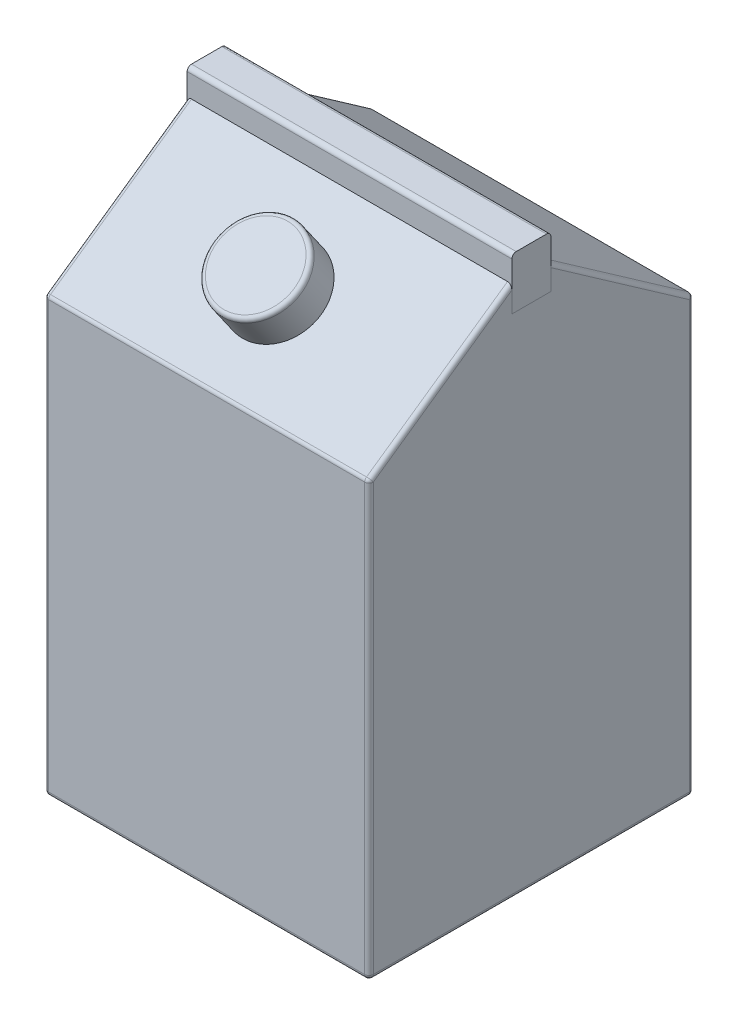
ISO-10303-21;
HEADER;
FILE_DESCRIPTION(('STEP AP214'),'2;1');
FILE_NAME('part.step','',(''),(''),'','','');
FILE_SCHEMA(('AUTOMOTIVE_DESIGN { 1 0 10303 214 1 1 1 1 }'));
ENDSEC;
DATA;
#1=APPLICATION_CONTEXT('core data for automotive mechanical design processes');
#2=APPLICATION_PROTOCOL_DEFINITION('international standard','automotive_design',2000,#1);
#3=PRODUCT_CONTEXT('',#1,'mechanical');
#4=PRODUCT('Part','Part','',(#3));
#5=PRODUCT_RELATED_PRODUCT_CATEGORY('part','',(#4));
#6=PRODUCT_DEFINITION_FORMATION('','',#4);
#7=PRODUCT_DEFINITION_CONTEXT('part definition',#1,'design');
#8=PRODUCT_DEFINITION('design','',#6,#7);
#9=PRODUCT_DEFINITION_SHAPE('','',#8);
#10=(LENGTH_UNIT() NAMED_UNIT(*) SI_UNIT(.MILLI.,.METRE.));
#11=(NAMED_UNIT(*) PLANE_ANGLE_UNIT() SI_UNIT($,.RADIAN.));
#12=(NAMED_UNIT(*) SI_UNIT($,.STERADIAN.) SOLID_ANGLE_UNIT());
#13=UNCERTAINTY_MEASURE_WITH_UNIT(LENGTH_MEASURE(1.E-05),#10,'distance_accuracy_value','');
#14=(GEOMETRIC_REPRESENTATION_CONTEXT(3) GLOBAL_UNCERTAINTY_ASSIGNED_CONTEXT((#13)) GLOBAL_UNIT_ASSIGNED_CONTEXT((#10,
#11,#12)) REPRESENTATION_CONTEXT('',''));
#15=CARTESIAN_POINT('',(0.,0.,0.));
#16=DIRECTION('',(0.,0.,1.));
#17=DIRECTION('',(1.,0.,0.));
#18=AXIS2_PLACEMENT_3D('',#15,#16,#17);
#19=CARTESIAN_POINT('',(0.,118.925792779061,26.1621879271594));
#20=DIRECTION('',(0.,-0.819152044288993,-0.573576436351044));
#21=DIRECTION('',(0.,0.573576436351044,-0.819152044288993));
#22=AXIS2_PLACEMENT_3D('',#19,#20,#21);
#23=CYLINDRICAL_SURFACE('',#22,10.);
#24=CARTESIAN_POINT('',(0.,118.106640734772,25.5886114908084));
#25=DIRECTION('',(0.,0.819152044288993,0.573576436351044));
#26=DIRECTION('',(0.,-0.573576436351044,0.819152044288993));
#27=AXIS2_PLACEMENT_3D('',#24,#25,#26);
#28=CIRCLE('',#27,10.);
#29=CARTESIAN_POINT('',(0.,112.370876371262,33.7801319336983));
#30=VERTEX_POINT('',#29);
#31=EDGE_CURVE('E11',#30,#30,#28,.F.);
#32=ORIENTED_EDGE('',*,*,#31,.T.);
#33=EDGE_LOOP('',(#32));
#34=FACE_BOUND('',#33,.T.);
#35=CARTESIAN_POINT('',(0.,111.55342438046,21.));
#36=DIRECTION('',(0.,0.819152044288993,0.573576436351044));
#37=DIRECTION('',(0.,-0.573576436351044,0.819152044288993));
#38=AXIS2_PLACEMENT_3D('',#35,#36,#37);
#39=CIRCLE('',#38,10.);
#40=CARTESIAN_POINT('',(0.,105.81766001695,29.1915204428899));
#41=VERTEX_POINT('',#40);
#42=EDGE_CURVE('E52',#41,#41,#39,.T.);
#43=ORIENTED_EDGE('',*,*,#42,.T.);
#44=EDGE_LOOP('',(#43));
#45=FACE_BOUND('',#44,.T.);
#46=ADVANCED_FACE('F41',(#34,#45),#23,.T.);
#47=CARTESIAN_POINT('',(0.,118.925792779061,26.1621879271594));
#48=DIRECTION('',(0.,0.819152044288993,0.573576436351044));
#49=DIRECTION('',(0.,-0.573576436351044,0.819152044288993));
#50=AXIS2_PLACEMENT_3D('',#47,#48,#49);
#51=PLANE('',#50);
#52=CARTESIAN_POINT('',(0.,118.925792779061,26.1621879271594));
#53=DIRECTION('',(0.,0.819152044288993,0.573576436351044));
#54=DIRECTION('',(0.,-0.573576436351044,0.819152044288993));
#55=AXIS2_PLACEMENT_3D('',#52,#53,#54);
#56=CIRCLE('',#55,9.);
#57=CARTESIAN_POINT('',(0.,113.763604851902,33.5345563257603));
#58=VERTEX_POINT('',#57);
#59=EDGE_CURVE('E48',#58,#58,#56,.T.);
#60=ORIENTED_EDGE('',*,*,#59,.T.);
#61=EDGE_LOOP('',(#60));
#62=FACE_BOUND('',#61,.T.);
#63=ADVANCED_FACE('F62',(#62),#51,.T.);
#64=CARTESIAN_POINT('',(0.,111.55342438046,21.));
#65=DIRECTION('',(0.,0.819152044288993,0.573576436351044));
#66=DIRECTION('',(0.,-0.573576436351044,0.819152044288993));
#67=AXIS2_PLACEMENT_3D('',#64,#65,#66);
#68=PLANE('',#67);
#69=ORIENTED_EDGE('',*,*,#42,.F.);
#70=EDGE_LOOP('',(#69));
#71=FACE_BOUND('',#70,.T.);
#72=ADVANCED_FACE('F60',(#71),#68,.F.);
#73=CARTESIAN_POINT('',(0.,118.106640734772,25.5886114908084));
#74=DIRECTION('',(0.,0.819152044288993,0.573576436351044));
#75=DIRECTION('',(0.,-0.573576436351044,0.819152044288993));
#76=AXIS2_PLACEMENT_3D('',#73,#74,#75);
#77=TOROIDAL_SURFACE('',#76,9.,1.);
#78=ORIENTED_EDGE('',*,*,#31,.F.);
#79=EDGE_LOOP('',(#78));
#80=FACE_BOUND('',#79,.T.);
#81=ORIENTED_EDGE('',*,*,#59,.F.);
#82=EDGE_LOOP('',(#81));
#83=FACE_BOUND('',#82,.T.);
#84=ADVANCED_FACE('F43',(#80,#83),#77,.T.);
#85=CLOSED_SHELL('',(#46,#63,#72,#84));
#86=MANIFOLD_SOLID_BREP('B2',#85);
#87=CARTESIAN_POINT('',(37.5,129.10684876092,-4.5));
#88=DIRECTION('',(0.,0.,1.));
#89=DIRECTION('',(1.,0.,0.));
#90=AXIS2_PLACEMENT_3D('',#87,#88,#89);
#91=PLANE('',#90);
#92=DIRECTION('',(0.,-1.,0.));
#93=VECTOR('',#92,1.);
#94=CARTESIAN_POINT('',(-37.5,129.10684876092,-4.5));
#95=LINE('',#94,#93);
#96=CARTESIAN_POINT('',(-37.5,128.10684876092,-4.5));
#97=VERTEX_POINT('',#96);
#98=CARTESIAN_POINT('',(-37.5,117.10684876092,-4.5));
#99=VERTEX_POINT('',#98);
#100=EDGE_CURVE('E157',#97,#99,#95,.T.);
#101=ORIENTED_EDGE('',*,*,#100,.F.);
#102=DIRECTION('',(-1.,0.,0.));
#103=VECTOR('',#102,1.);
#104=CARTESIAN_POINT('',(37.5,128.10684876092,-4.5));
#105=LINE('',#104,#103);
#106=CARTESIAN_POINT('',(37.5,128.10684876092,-4.5));
#107=VERTEX_POINT('',#106);
#108=EDGE_CURVE('E128',#97,#107,#105,.F.);
#109=ORIENTED_EDGE('',*,*,#108,.T.);
#110=DIRECTION('',(0.,-1.,0.));
#111=VECTOR('',#110,1.);
#112=CARTESIAN_POINT('',(37.5,129.10684876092,-4.5));
#113=LINE('',#112,#111);
#114=CARTESIAN_POINT('',(37.5,117.10684876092,-4.5));
#115=VERTEX_POINT('',#114);
#116=EDGE_CURVE('E177',#107,#115,#113,.T.);
#117=ORIENTED_EDGE('',*,*,#116,.T.);
#118=DIRECTION('',(-1.,0.,0.));
#119=VECTOR('',#118,1.);
#120=CARTESIAN_POINT('',(37.5,117.10684876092,-4.5));
#121=LINE('',#120,#119);
#122=EDGE_CURVE('E173',#115,#99,#121,.T.);
#123=ORIENTED_EDGE('',*,*,#122,.T.);
#124=EDGE_LOOP('',(#101,#109,#117,#123));
#125=FACE_BOUND('',#124,.T.);
#126=ADVANCED_FACE('F105',(#125),#91,.F.);
#127=CARTESIAN_POINT('',(-37.5,129.10684876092,-4.5));
#128=DIRECTION('',(1.,0.,0.));
#129=DIRECTION('',(0.,0.,-1.));
#130=AXIS2_PLACEMENT_3D('',#127,#128,#129);
#131=PLANE('',#130);
#132=DIRECTION('',(0.,0.,1.));
#133=VECTOR('',#132,1.);
#134=CARTESIAN_POINT('',(-37.5,129.10684876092,-4.5));
#135=LINE('',#134,#133);
#136=CARTESIAN_POINT('',(-37.5,129.10684876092,-3.5));
#137=VERTEX_POINT('',#136);
#138=CARTESIAN_POINT('',(-37.5,129.10684876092,3.5));
#139=VERTEX_POINT('',#138);
#140=EDGE_CURVE('E187',#137,#139,#135,.T.);
#141=ORIENTED_EDGE('',*,*,#140,.F.);
#142=CARTESIAN_POINT('',(-37.5,128.10684876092,-3.5));
#143=DIRECTION('',(1.,0.,0.));
#144=DIRECTION('',(0.,0.,-1.));
#145=AXIS2_PLACEMENT_3D('',#142,#143,#144);
#146=CIRCLE('',#145,1.);
#147=EDGE_CURVE('E164',#137,#97,#146,.F.);
#148=ORIENTED_EDGE('',*,*,#147,.T.);
#149=ORIENTED_EDGE('',*,*,#100,.T.);
#150=DIRECTION('',(0.,0.,1.));
#151=VECTOR('',#150,1.);
#152=CARTESIAN_POINT('',(-37.5,117.10684876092,-4.5));
#153=LINE('',#152,#151);
#154=CARTESIAN_POINT('',(-37.5,117.10684876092,4.5));
#155=VERTEX_POINT('',#154);
#156=EDGE_CURVE('E162',#99,#155,#153,.T.);
#157=ORIENTED_EDGE('',*,*,#156,.T.);
#158=DIRECTION('',(0.,-1.,0.));
#159=VECTOR('',#158,1.);
#160=CARTESIAN_POINT('',(-37.5,129.10684876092,4.5));
#161=LINE('',#160,#159);
#162=CARTESIAN_POINT('',(-37.5,128.10684876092,4.5));
#163=VERTEX_POINT('',#162);
#164=EDGE_CURVE('E167',#163,#155,#161,.T.);
#165=ORIENTED_EDGE('',*,*,#164,.F.);
#166=CARTESIAN_POINT('',(-37.5,128.10684876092,3.5));
#167=DIRECTION('',(1.,0.,0.));
#168=DIRECTION('',(0.,0.,-1.));
#169=AXIS2_PLACEMENT_3D('',#166,#167,#168);
#170=CIRCLE('',#169,1.);
#171=EDGE_CURVE('E197',#163,#139,#170,.F.);
#172=ORIENTED_EDGE('',*,*,#171,.T.);
#173=EDGE_LOOP('',(#141,#148,#149,#157,#165,#172));
#174=FACE_BOUND('',#173,.T.);
#175=ADVANCED_FACE('F160',(#174),#131,.F.);
#176=CARTESIAN_POINT('',(-37.5,129.10684876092,4.5));
#177=DIRECTION('',(0.,0.,-1.));
#178=DIRECTION('',(-1.,0.,0.));
#179=AXIS2_PLACEMENT_3D('',#176,#177,#178);
#180=PLANE('',#179);
#181=DIRECTION('',(0.,-1.,0.));
#182=VECTOR('',#181,1.);
#183=CARTESIAN_POINT('',(37.5,129.10684876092,4.5));
#184=LINE('',#183,#182);
#185=CARTESIAN_POINT('',(37.5,128.10684876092,4.5));
#186=VERTEX_POINT('',#185);
#187=CARTESIAN_POINT('',(37.5,117.10684876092,4.5));
#188=VERTEX_POINT('',#187);
#189=EDGE_CURVE('E189',#186,#188,#184,.T.);
#190=ORIENTED_EDGE('',*,*,#189,.F.);
#191=DIRECTION('',(1.,0.,0.));
#192=VECTOR('',#191,1.);
#193=CARTESIAN_POINT('',(-37.5,128.10684876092,4.5));
#194=LINE('',#193,#192);
#195=EDGE_CURVE('E39',#186,#163,#194,.F.);
#196=ORIENTED_EDGE('',*,*,#195,.T.);
#197=ORIENTED_EDGE('',*,*,#164,.T.);
#198=DIRECTION('',(1.,0.,0.));
#199=VECTOR('',#198,1.);
#200=CARTESIAN_POINT('',(-37.5,117.10684876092,4.5));
#201=LINE('',#200,#199);
#202=EDGE_CURVE('E175',#155,#188,#201,.T.);
#203=ORIENTED_EDGE('',*,*,#202,.T.);
#204=EDGE_LOOP('',(#190,#196,#197,#203));
#205=FACE_BOUND('',#204,.T.);
#206=ADVANCED_FACE('F223',(#205),#180,.F.);
#207=CARTESIAN_POINT('',(37.5,129.10684876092,4.5));
#208=DIRECTION('',(-1.,0.,0.));
#209=DIRECTION('',(0.,0.,1.));
#210=AXIS2_PLACEMENT_3D('',#207,#208,#209);
#211=PLANE('',#210);
#212=ORIENTED_EDGE('',*,*,#116,.F.);
#213=CARTESIAN_POINT('',(37.5,128.10684876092,-3.5));
#214=DIRECTION('',(-1.,0.,0.));
#215=DIRECTION('',(0.,0.,1.));
#216=AXIS2_PLACEMENT_3D('',#213,#214,#215);
#217=CIRCLE('',#216,1.);
#218=CARTESIAN_POINT('',(37.5,129.10684876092,-3.5));
#219=VERTEX_POINT('',#218);
#220=EDGE_CURVE('E113',#107,#219,#217,.F.);
#221=ORIENTED_EDGE('',*,*,#220,.T.);
#222=DIRECTION('',(0.,0.,-1.));
#223=VECTOR('',#222,1.);
#224=CARTESIAN_POINT('',(37.5,129.10684876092,4.5));
#225=LINE('',#224,#223);
#226=CARTESIAN_POINT('',(37.5,129.10684876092,3.5));
#227=VERTEX_POINT('',#226);
#228=EDGE_CURVE('E181',#227,#219,#225,.T.);
#229=ORIENTED_EDGE('',*,*,#228,.F.);
#230=CARTESIAN_POINT('',(37.5,128.10684876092,3.5));
#231=DIRECTION('',(-1.,0.,0.));
#232=DIRECTION('',(0.,0.,1.));
#233=AXIS2_PLACEMENT_3D('',#230,#231,#232);
#234=CIRCLE('',#233,1.);
#235=EDGE_CURVE('E120',#227,#186,#234,.F.);
#236=ORIENTED_EDGE('',*,*,#235,.T.);
#237=ORIENTED_EDGE('',*,*,#189,.T.);
#238=DIRECTION('',(0.,0.,-1.));
#239=VECTOR('',#238,1.);
#240=CARTESIAN_POINT('',(37.5,117.10684876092,4.5));
#241=LINE('',#240,#239);
#242=EDGE_CURVE('E185',#188,#115,#241,.T.);
#243=ORIENTED_EDGE('',*,*,#242,.T.);
#244=EDGE_LOOP('',(#212,#221,#229,#236,#237,#243));
#245=FACE_BOUND('',#244,.T.);
#246=ADVANCED_FACE('F203',(#245),#211,.F.);
#247=CARTESIAN_POINT('',(0.,129.10684876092,0.));
#248=DIRECTION('',(0.,1.,0.));
#249=DIRECTION('',(0.,0.,1.));
#250=AXIS2_PLACEMENT_3D('',#247,#248,#249);
#251=PLANE('',#250);
#252=ORIENTED_EDGE('',*,*,#228,.T.);
#253=DIRECTION('',(-1.,0.,0.));
#254=VECTOR('',#253,1.);
#255=CARTESIAN_POINT('',(-37.5,129.10684876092,-3.5));
#256=LINE('',#255,#254);
#257=EDGE_CURVE('E194',#219,#137,#256,.T.);
#258=ORIENTED_EDGE('',*,*,#257,.T.);
#259=ORIENTED_EDGE('',*,*,#140,.T.);
#260=DIRECTION('',(1.,0.,0.));
#261=VECTOR('',#260,1.);
#262=CARTESIAN_POINT('',(37.5,129.10684876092,3.5));
#263=LINE('',#262,#261);
#264=EDGE_CURVE('E166',#139,#227,#263,.T.);
#265=ORIENTED_EDGE('',*,*,#264,.T.);
#266=EDGE_LOOP('',(#252,#258,#259,#265));
#267=FACE_BOUND('',#266,.T.);
#268=ADVANCED_FACE('F207',(#267),#251,.T.);
#269=CARTESIAN_POINT('',(0.,117.10684876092,0.));
#270=DIRECTION('',(0.,1.,0.));
#271=DIRECTION('',(0.,0.,1.));
#272=AXIS2_PLACEMENT_3D('',#269,#270,#271);
#273=PLANE('',#272);
#274=ORIENTED_EDGE('',*,*,#122,.F.);
#275=ORIENTED_EDGE('',*,*,#242,.F.);
#276=ORIENTED_EDGE('',*,*,#202,.F.);
#277=ORIENTED_EDGE('',*,*,#156,.F.);
#278=EDGE_LOOP('',(#274,#275,#276,#277));
#279=FACE_BOUND('',#278,.T.);
#280=ADVANCED_FACE('F171',(#279),#273,.F.);
#281=CARTESIAN_POINT('',(0.,128.10684876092,-3.5));
#282=DIRECTION('',(1.,0.,0.));
#283=DIRECTION('',(0.,0.,-1.));
#284=AXIS2_PLACEMENT_3D('',#281,#282,#283);
#285=CYLINDRICAL_SURFACE('',#284,1.);
#286=ORIENTED_EDGE('',*,*,#220,.F.);
#287=ORIENTED_EDGE('',*,*,#108,.F.);
#288=ORIENTED_EDGE('',*,*,#147,.F.);
#289=ORIENTED_EDGE('',*,*,#257,.F.);
#290=EDGE_LOOP('',(#286,#287,#288,#289));
#291=FACE_BOUND('',#290,.T.);
#292=ADVANCED_FACE('F210',(#291),#285,.T.);
#293=CARTESIAN_POINT('',(0.,128.10684876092,3.5));
#294=DIRECTION('',(-1.,0.,0.));
#295=DIRECTION('',(0.,0.,1.));
#296=AXIS2_PLACEMENT_3D('',#293,#294,#295);
#297=CYLINDRICAL_SURFACE('',#296,1.);
#298=ORIENTED_EDGE('',*,*,#171,.F.);
#299=ORIENTED_EDGE('',*,*,#195,.F.);
#300=ORIENTED_EDGE('',*,*,#235,.F.);
#301=ORIENTED_EDGE('',*,*,#264,.F.);
#302=EDGE_LOOP('',(#298,#299,#300,#301));
#303=FACE_BOUND('',#302,.T.);
#304=ADVANCED_FACE('F107',(#303),#297,.T.);
#305=CLOSED_SHELL('',(#126,#175,#206,#246,#268,#280,#292,#304));
#306=MANIFOLD_SOLID_BREP('B6',#305);
#307=CARTESIAN_POINT('',(37.5,100.,37.5));
#308=DIRECTION('',(0.,0.,-1.));
#309=DIRECTION('',(0.,1.,0.));
#310=AXIS2_PLACEMENT_3D('',#307,#308,#309);
#311=PLANE('',#310);
#312=DIRECTION('',(-1.,0.,0.));
#313=VECTOR('',#312,1.);
#314=CARTESIAN_POINT('',(37.5,99.4794329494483,37.5));
#315=LINE('',#314,#313);
#316=CARTESIAN_POINT('',(36.5,99.4794329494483,37.5));
#317=VERTEX_POINT('',#316);
#318=CARTESIAN_POINT('',(-36.5,99.4794329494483,37.5));
#319=VERTEX_POINT('',#318);
#320=EDGE_CURVE('E455',#317,#319,#315,.T.);
#321=ORIENTED_EDGE('',*,*,#320,.T.);
#322=DIRECTION('',(0.,-1.,0.));
#323=VECTOR('',#322,1.);
#324=CARTESIAN_POINT('',(-36.5,100.,37.5));
#325=LINE('',#324,#323);
#326=CARTESIAN_POINT('',(-36.5,1.,37.5));
#327=VERTEX_POINT('',#326);
#328=EDGE_CURVE('E460',#319,#327,#325,.T.);
#329=ORIENTED_EDGE('',*,*,#328,.T.);
#330=DIRECTION('',(-1.,0.,0.));
#331=VECTOR('',#330,1.);
#332=CARTESIAN_POINT('',(37.5,1.,37.5));
#333=LINE('',#332,#331);
#334=CARTESIAN_POINT('',(36.5,1.,37.5));
#335=VERTEX_POINT('',#334);
#336=EDGE_CURVE('E457',#327,#335,#333,.F.);
#337=ORIENTED_EDGE('',*,*,#336,.T.);
#338=DIRECTION('',(0.,-1.,0.));
#339=VECTOR('',#338,1.);
#340=CARTESIAN_POINT('',(36.5,100.,37.5));
#341=LINE('',#340,#339);
#342=EDGE_CURVE('E453',#335,#317,#341,.F.);
#343=ORIENTED_EDGE('',*,*,#342,.T.);
#344=EDGE_LOOP('',(#321,#329,#337,#343));
#345=FACE_BOUND('',#344,.T.);
#346=ADVANCED_FACE('F280',(#345),#311,.F.);
#347=CARTESIAN_POINT('',(37.5,0.,37.5));
#348=DIRECTION('',(0.,1.,0.));
#349=DIRECTION('',(0.,0.,1.));
#350=AXIS2_PLACEMENT_3D('',#347,#348,#349);
#351=PLANE('',#350);
#352=DIRECTION('',(0.,0.,-1.));
#353=VECTOR('',#352,1.);
#354=CARTESIAN_POINT('',(36.5,0.,37.5));
#355=LINE('',#354,#353);
#356=CARTESIAN_POINT('',(36.5,0.,-36.5));
#357=VERTEX_POINT('',#356);
#358=CARTESIAN_POINT('',(36.5,0.,36.5));
#359=VERTEX_POINT('',#358);
#360=EDGE_CURVE('E448',#357,#359,#355,.F.);
#361=ORIENTED_EDGE('',*,*,#360,.T.);
#362=DIRECTION('',(-1.,0.,0.));
#363=VECTOR('',#362,1.);
#364=CARTESIAN_POINT('',(37.5,0.,36.5));
#365=LINE('',#364,#363);
#366=CARTESIAN_POINT('',(-36.5,0.,36.5));
#367=VERTEX_POINT('',#366);
#368=EDGE_CURVE('E450',#359,#367,#365,.T.);
#369=ORIENTED_EDGE('',*,*,#368,.T.);
#370=DIRECTION('',(0.,0.,-1.));
#371=VECTOR('',#370,1.);
#372=CARTESIAN_POINT('',(-36.5,0.,37.5));
#373=LINE('',#372,#371);
#374=CARTESIAN_POINT('',(-36.5,0.,-36.5));
#375=VERTEX_POINT('',#374);
#376=EDGE_CURVE('E444',#367,#375,#373,.T.);
#377=ORIENTED_EDGE('',*,*,#376,.T.);
#378=DIRECTION('',(-1.,0.,0.));
#379=VECTOR('',#378,1.);
#380=CARTESIAN_POINT('',(37.5,0.,-36.5));
#381=LINE('',#380,#379);
#382=EDGE_CURVE('E446',#375,#357,#381,.F.);
#383=ORIENTED_EDGE('',*,*,#382,.T.);
#384=EDGE_LOOP('',(#361,#369,#377,#383));
#385=FACE_BOUND('',#384,.T.);
#386=ADVANCED_FACE('F624',(#385),#351,.F.);
#387=CARTESIAN_POINT('',(37.5,100.,-37.5));
#388=DIRECTION('',(0.,0.,1.));
#389=DIRECTION('',(0.,-1.,0.));
#390=AXIS2_PLACEMENT_3D('',#387,#388,#389);
#391=PLANE('',#390);
#392=DIRECTION('',(0.,1.,0.));
#393=VECTOR('',#392,1.);
#394=CARTESIAN_POINT('',(36.5,0.,-37.5));
#395=LINE('',#394,#393);
#396=CARTESIAN_POINT('',(36.5,99.4794329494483,-37.5));
#397=VERTEX_POINT('',#396);
#398=CARTESIAN_POINT('',(36.5,1.00000000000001,-37.5));
#399=VERTEX_POINT('',#398);
#400=EDGE_CURVE('E472',#397,#399,#395,.F.);
#401=ORIENTED_EDGE('',*,*,#400,.T.);
#402=DIRECTION('',(-1.,0.,0.));
#403=VECTOR('',#402,1.);
#404=CARTESIAN_POINT('',(37.5,1.00000000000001,-37.5));
#405=LINE('',#404,#403);
#406=CARTESIAN_POINT('',(-36.5,1.00000000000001,-37.5));
#407=VERTEX_POINT('',#406);
#408=EDGE_CURVE('E478',#399,#407,#405,.T.);
#409=ORIENTED_EDGE('',*,*,#408,.T.);
#410=DIRECTION('',(0.,1.,0.));
#411=VECTOR('',#410,1.);
#412=CARTESIAN_POINT('',(-36.5,100.,-37.5));
#413=LINE('',#412,#411);
#414=CARTESIAN_POINT('',(-36.5,99.4794329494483,-37.5));
#415=VERTEX_POINT('',#414);
#416=EDGE_CURVE('E476',#407,#415,#413,.T.);
#417=ORIENTED_EDGE('',*,*,#416,.T.);
#418=DIRECTION('',(-1.,0.,0.));
#419=VECTOR('',#418,1.);
#420=CARTESIAN_POINT('',(37.5,99.4794329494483,-37.5));
#421=LINE('',#420,#419);
#422=EDGE_CURVE('E474',#415,#397,#421,.F.);
#423=ORIENTED_EDGE('',*,*,#422,.T.);
#424=EDGE_LOOP('',(#401,#409,#417,#423));
#425=FACE_BOUND('',#424,.T.);
#426=ADVANCED_FACE('F584',(#425),#391,.F.);
#427=CARTESIAN_POINT('',(37.5,123.10684876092,-4.49999999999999));
#428=DIRECTION('',(0.,-0.819152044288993,0.573576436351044));
#429=DIRECTION('',(0.,-0.573576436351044,-0.819152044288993));
#430=AXIS2_PLACEMENT_3D('',#427,#428,#429);
#431=PLANE('',#430);
#432=DIRECTION('',(-1.,0.,0.));
#433=VECTOR('',#432,1.);
#434=CARTESIAN_POINT('',(37.5,100.298584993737,-37.073576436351));
#435=LINE('',#434,#433);
#436=CARTESIAN_POINT('',(36.5,100.298584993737,-37.073576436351));
#437=VERTEX_POINT('',#436);
#438=CARTESIAN_POINT('',(-36.5,100.298584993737,-37.073576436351));
#439=VERTEX_POINT('',#438);
#440=EDGE_CURVE('E493',#437,#439,#435,.T.);
#441=ORIENTED_EDGE('',*,*,#440,.T.);
#442=DIRECTION('',(0.,0.573576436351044,0.819152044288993));
#443=VECTOR('',#442,1.);
#444=CARTESIAN_POINT('',(-36.5,123.10684876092,-4.49999999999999));
#445=LINE('',#444,#443);
#446=CARTESIAN_POINT('',(-36.5,123.10684876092,-4.49999999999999));
#447=VERTEX_POINT('',#446);
#448=EDGE_CURVE('E495',#439,#447,#445,.T.);
#449=ORIENTED_EDGE('',*,*,#448,.T.);
#450=DIRECTION('',(-1.,0.,0.));
#451=VECTOR('',#450,1.);
#452=CARTESIAN_POINT('',(37.5,123.10684876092,-4.49999999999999));
#453=LINE('',#452,#451);
#454=CARTESIAN_POINT('',(36.5,123.10684876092,-4.49999999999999));
#455=VERTEX_POINT('',#454);
#456=EDGE_CURVE('E425',#455,#447,#453,.T.);
#457=ORIENTED_EDGE('',*,*,#456,.F.);
#458=DIRECTION('',(0.,0.573576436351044,0.819152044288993));
#459=VECTOR('',#458,1.);
#460=CARTESIAN_POINT('',(36.5,100.,-37.5));
#461=LINE('',#460,#459);
#462=EDGE_CURVE('E491',#455,#437,#461,.F.);
#463=ORIENTED_EDGE('',*,*,#462,.T.);
#464=EDGE_LOOP('',(#441,#449,#457,#463));
#465=FACE_BOUND('',#464,.T.);
#466=ADVANCED_FACE('F614',(#465),#431,.F.);
#467=CARTESIAN_POINT('',(37.5,117.10684876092,-4.5));
#468=DIRECTION('',(0.,0.,-1.));
#469=DIRECTION('',(0.,1.,0.));
#470=AXIS2_PLACEMENT_3D('',#467,#468,#469);
#471=PLANE('',#470);
#472=ORIENTED_EDGE('',*,*,#456,.T.);
#473=CARTESIAN_POINT('',(-36.5,121.886074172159,-4.49999999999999));
#474=DIRECTION('',(0.,0.,-1.));
#475=DIRECTION('',(0.,1.,0.));
#476=AXIS2_PLACEMENT_3D('',#473,#474,#475);
#477=ELLIPSE('',#476,1.22077458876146,1.);
#478=CARTESIAN_POINT('',(-37.5,121.886074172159,-4.49999999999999));
#479=VERTEX_POINT('',#478);
#480=EDGE_CURVE('E499',#447,#479,#477,.F.);
#481=ORIENTED_EDGE('',*,*,#480,.T.);
#482=DIRECTION('',(0.,-1.,0.));
#483=VECTOR('',#482,1.);
#484=CARTESIAN_POINT('',(-37.5,117.10684876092,-4.5));
#485=LINE('',#484,#483);
#486=CARTESIAN_POINT('',(-37.5,117.10684876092,-4.5));
#487=VERTEX_POINT('',#486);
#488=EDGE_CURVE('E422',#479,#487,#485,.T.);
#489=ORIENTED_EDGE('',*,*,#488,.T.);
#490=DIRECTION('',(-1.,0.,0.));
#491=VECTOR('',#490,1.);
#492=CARTESIAN_POINT('',(37.5,117.10684876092,-4.5));
#493=LINE('',#492,#491);
#494=CARTESIAN_POINT('',(37.5,117.10684876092,-4.5));
#495=VERTEX_POINT('',#494);
#496=EDGE_CURVE('E418',#495,#487,#493,.T.);
#497=ORIENTED_EDGE('',*,*,#496,.F.);
#498=DIRECTION('',(0.,-1.,0.));
#499=VECTOR('',#498,1.);
#500=CARTESIAN_POINT('',(37.5,117.10684876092,-4.5));
#501=LINE('',#500,#499);
#502=CARTESIAN_POINT('',(37.5,121.886074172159,-4.49999999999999));
#503=VERTEX_POINT('',#502);
#504=EDGE_CURVE('E404',#503,#495,#501,.T.);
#505=ORIENTED_EDGE('',*,*,#504,.F.);
#506=CARTESIAN_POINT('',(36.5,121.886074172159,-4.5));
#507=DIRECTION('',(0.,0.,-1.));
#508=DIRECTION('',(0.,-1.,0.));
#509=AXIS2_PLACEMENT_3D('',#506,#507,#508);
#510=ELLIPSE('',#509,1.22077458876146,1.);
#511=EDGE_CURVE('E497',#503,#455,#510,.F.);
#512=ORIENTED_EDGE('',*,*,#511,.T.);
#513=EDGE_LOOP('',(#472,#481,#489,#497,#505,#512));
#514=FACE_BOUND('',#513,.T.);
#515=ADVANCED_FACE('F420',(#514),#471,.F.);
#516=CARTESIAN_POINT('',(37.5,117.10684876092,4.5));
#517=DIRECTION('',(0.,-1.,0.));
#518=DIRECTION('',(0.,0.,-1.));
#519=AXIS2_PLACEMENT_3D('',#516,#517,#518);
#520=PLANE('',#519);
#521=DIRECTION('',(0.,0.,1.));
#522=VECTOR('',#521,1.);
#523=CARTESIAN_POINT('',(-37.5,117.10684876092,4.5));
#524=LINE('',#523,#522);
#525=CARTESIAN_POINT('',(-37.5,117.10684876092,4.5));
#526=VERTEX_POINT('',#525);
#527=EDGE_CURVE('E437',#487,#526,#524,.T.);
#528=ORIENTED_EDGE('',*,*,#527,.T.);
#529=DIRECTION('',(-1.,0.,0.));
#530=VECTOR('',#529,1.);
#531=CARTESIAN_POINT('',(37.5,117.10684876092,4.5));
#532=LINE('',#531,#530);
#533=CARTESIAN_POINT('',(37.5,117.10684876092,4.5));
#534=VERTEX_POINT('',#533);
#535=EDGE_CURVE('E426',#534,#526,#532,.T.);
#536=ORIENTED_EDGE('',*,*,#535,.F.);
#537=DIRECTION('',(0.,0.,1.));
#538=VECTOR('',#537,1.);
#539=CARTESIAN_POINT('',(37.5,117.10684876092,4.5));
#540=LINE('',#539,#538);
#541=EDGE_CURVE('E409',#495,#534,#540,.T.);
#542=ORIENTED_EDGE('',*,*,#541,.F.);
#543=ORIENTED_EDGE('',*,*,#496,.T.);
#544=EDGE_LOOP('',(#528,#536,#542,#543));
#545=FACE_BOUND('',#544,.T.);
#546=ADVANCED_FACE('F428',(#545),#520,.F.);
#547=CARTESIAN_POINT('',(37.5,123.10684876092,4.49999999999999));
#548=DIRECTION('',(0.,0.,1.));
#549=DIRECTION('',(0.,-1.,0.));
#550=AXIS2_PLACEMENT_3D('',#547,#548,#549);
#551=PLANE('',#550);
#552=DIRECTION('',(0.,1.,0.));
#553=VECTOR('',#552,1.);
#554=CARTESIAN_POINT('',(-37.5,123.10684876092,4.49999999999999));
#555=LINE('',#554,#553);
#556=CARTESIAN_POINT('',(-37.5,121.886074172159,4.49999999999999));
#557=VERTEX_POINT('',#556);
#558=EDGE_CURVE('E415',#526,#557,#555,.T.);
#559=ORIENTED_EDGE('',*,*,#558,.T.);
#560=CARTESIAN_POINT('',(-36.5,121.886074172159,4.5));
#561=DIRECTION('',(0.,0.,1.));
#562=DIRECTION('',(0.,-1.,0.));
#563=AXIS2_PLACEMENT_3D('',#560,#561,#562);
#564=ELLIPSE('',#563,1.22077458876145,1.);
#565=CARTESIAN_POINT('',(-36.5,123.10684876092,4.49999999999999));
#566=VERTEX_POINT('',#565);
#567=EDGE_CURVE('E103',#557,#566,#564,.F.);
#568=ORIENTED_EDGE('',*,*,#567,.T.);
#569=DIRECTION('',(-1.,0.,0.));
#570=VECTOR('',#569,1.);
#571=CARTESIAN_POINT('',(37.5,123.10684876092,4.49999999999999));
#572=LINE('',#571,#570);
#573=CARTESIAN_POINT('',(36.5,123.10684876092,4.49999999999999));
#574=VERTEX_POINT('',#573);
#575=EDGE_CURVE('E433',#574,#566,#572,.T.);
#576=ORIENTED_EDGE('',*,*,#575,.F.);
#577=CARTESIAN_POINT('',(36.5,121.886074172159,4.5));
#578=DIRECTION('',(0.,0.,1.));
#579=DIRECTION('',(0.,1.,0.));
#580=AXIS2_PLACEMENT_3D('',#577,#578,#579);
#581=ELLIPSE('',#580,1.22077458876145,1.);
#582=CARTESIAN_POINT('',(37.5,121.886074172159,4.49999999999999));
#583=VERTEX_POINT('',#582);
#584=EDGE_CURVE('E289',#574,#583,#581,.F.);
#585=ORIENTED_EDGE('',*,*,#584,.T.);
#586=DIRECTION('',(0.,1.,0.));
#587=VECTOR('',#586,1.);
#588=CARTESIAN_POINT('',(37.5,123.10684876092,4.49999999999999));
#589=LINE('',#588,#587);
#590=EDGE_CURVE('E431',#534,#583,#589,.T.);
#591=ORIENTED_EDGE('',*,*,#590,.F.);
#592=ORIENTED_EDGE('',*,*,#535,.T.);
#593=EDGE_LOOP('',(#559,#568,#576,#585,#591,#592));
#594=FACE_BOUND('',#593,.T.);
#595=ADVANCED_FACE('F849',(#594),#551,.F.);
#596=CARTESIAN_POINT('',(37.5,100.,37.5));
#597=DIRECTION('',(0.,-0.819152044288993,-0.573576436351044));
#598=DIRECTION('',(0.,0.573576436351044,-0.819152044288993));
#599=AXIS2_PLACEMENT_3D('',#596,#597,#598);
#600=PLANE('',#599);
#601=ORIENTED_EDGE('',*,*,#575,.T.);
#602=DIRECTION('',(0.,-0.573576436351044,0.819152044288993));
#603=VECTOR('',#602,1.);
#604=CARTESIAN_POINT('',(-36.5,100.,37.5));
#605=LINE('',#604,#603);
#606=CARTESIAN_POINT('',(-36.5,100.298584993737,37.0735764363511));
#607=VERTEX_POINT('',#606);
#608=EDGE_CURVE('E297',#566,#607,#605,.T.);
#609=ORIENTED_EDGE('',*,*,#608,.T.);
#610=DIRECTION('',(-1.,0.,0.));
#611=VECTOR('',#610,1.);
#612=CARTESIAN_POINT('',(37.5,100.298584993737,37.0735764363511));
#613=LINE('',#612,#611);
#614=CARTESIAN_POINT('',(36.5,100.298584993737,37.0735764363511));
#615=VERTEX_POINT('',#614);
#616=EDGE_CURVE('E301',#607,#615,#613,.F.);
#617=ORIENTED_EDGE('',*,*,#616,.T.);
#618=DIRECTION('',(0.,-0.573576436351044,0.819152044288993));
#619=VECTOR('',#618,1.);
#620=CARTESIAN_POINT('',(36.5,123.10684876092,4.5));
#621=LINE('',#620,#619);
#622=EDGE_CURVE('E501',#615,#574,#621,.F.);
#623=ORIENTED_EDGE('',*,*,#622,.T.);
#624=EDGE_LOOP('',(#601,#609,#617,#623));
#625=FACE_BOUND('',#624,.T.);
#626=ADVANCED_FACE('F841',(#625),#600,.F.);
#627=CARTESIAN_POINT('',(37.5,0.,0.));
#628=DIRECTION('',(1.,0.,0.));
#629=DIRECTION('',(0.,0.,-1.));
#630=AXIS2_PLACEMENT_3D('',#627,#628,#629);
#631=PLANE('',#630);
#632=DIRECTION('',(0.,1.,0.));
#633=VECTOR('',#632,1.);
#634=CARTESIAN_POINT('',(37.5,100.,-36.5));
#635=LINE('',#634,#633);
#636=CARTESIAN_POINT('',(37.5,1.00000000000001,-36.5));
#637=VERTEX_POINT('',#636);
#638=CARTESIAN_POINT('',(37.5,99.4794329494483,-36.5));
#639=VERTEX_POINT('',#638);
#640=EDGE_CURVE('E469',#637,#639,#635,.T.);
#641=ORIENTED_EDGE('',*,*,#640,.T.);
#642=DIRECTION('',(0.,0.573576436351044,0.819152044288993));
#643=VECTOR('',#642,1.);
#644=CARTESIAN_POINT('',(37.5,122.287696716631,-3.92642356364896));
#645=LINE('',#644,#643);
#646=EDGE_CURVE('E412',#639,#503,#645,.T.);
#647=ORIENTED_EDGE('',*,*,#646,.T.);
#648=ORIENTED_EDGE('',*,*,#504,.T.);
#649=ORIENTED_EDGE('',*,*,#541,.T.);
#650=ORIENTED_EDGE('',*,*,#590,.T.);
#651=DIRECTION('',(0.,-0.573576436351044,0.819152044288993));
#652=VECTOR('',#651,1.);
#653=CARTESIAN_POINT('',(37.5,99.180847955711,36.926423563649));
#654=LINE('',#653,#652);
#655=CARTESIAN_POINT('',(37.5,99.4794329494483,36.5));
#656=VERTEX_POINT('',#655);
#657=EDGE_CURVE('E464',#583,#656,#654,.T.);
#658=ORIENTED_EDGE('',*,*,#657,.T.);
#659=DIRECTION('',(0.,-1.,0.));
#660=VECTOR('',#659,1.);
#661=CARTESIAN_POINT('',(37.5,0.,36.5));
#662=LINE('',#661,#660);
#663=CARTESIAN_POINT('',(37.5,1.,36.5));
#664=VERTEX_POINT('',#663);
#665=EDGE_CURVE('E462',#656,#664,#662,.T.);
#666=ORIENTED_EDGE('',*,*,#665,.T.);
#667=DIRECTION('',(0.,0.,-1.));
#668=VECTOR('',#667,1.);
#669=CARTESIAN_POINT('',(37.5,1.00000000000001,-37.5));
#670=LINE('',#669,#668);
#671=EDGE_CURVE('E466',#664,#637,#670,.T.);
#672=ORIENTED_EDGE('',*,*,#671,.T.);
#673=EDGE_LOOP('',(#641,#647,#648,#649,#650,#658,#666,#672));
#674=FACE_BOUND('',#673,.T.);
#675=ADVANCED_FACE('F406',(#674),#631,.T.);
#676=CARTESIAN_POINT('',(-37.5,0.,0.));
#677=DIRECTION('',(1.,0.,0.));
#678=DIRECTION('',(0.,0.,-1.));
#679=AXIS2_PLACEMENT_3D('',#676,#677,#678);
#680=PLANE('',#679);
#681=ORIENTED_EDGE('',*,*,#488,.F.);
#682=DIRECTION('',(0.,0.573576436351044,0.819152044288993));
#683=VECTOR('',#682,1.);
#684=CARTESIAN_POINT('',(-37.5,83.9010917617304,-58.7481769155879));
#685=LINE('',#684,#683);
#686=CARTESIAN_POINT('',(-37.5,99.4794329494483,-36.5));
#687=VERTEX_POINT('',#686);
#688=EDGE_CURVE('E489',#479,#687,#685,.F.);
#689=ORIENTED_EDGE('',*,*,#688,.T.);
#690=DIRECTION('',(0.,1.,0.));
#691=VECTOR('',#690,1.);
#692=CARTESIAN_POINT('',(-37.5,0.,-36.5));
#693=LINE('',#692,#691);
#694=CARTESIAN_POINT('',(-37.5,1.00000000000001,-36.5));
#695=VERTEX_POINT('',#694);
#696=EDGE_CURVE('E487',#687,#695,#693,.F.);
#697=ORIENTED_EDGE('',*,*,#696,.T.);
#698=DIRECTION('',(0.,0.,-1.));
#699=VECTOR('',#698,1.);
#700=CARTESIAN_POINT('',(-37.5,1.00000000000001,0.));
#701=LINE('',#700,#699);
#702=CARTESIAN_POINT('',(-37.5,1.,36.5));
#703=VERTEX_POINT('',#702);
#704=EDGE_CURVE('E485',#695,#703,#701,.F.);
#705=ORIENTED_EDGE('',*,*,#704,.T.);
#706=DIRECTION('',(0.,-1.,0.));
#707=VECTOR('',#706,1.);
#708=CARTESIAN_POINT('',(-37.5,0.,36.5));
#709=LINE('',#708,#707);
#710=CARTESIAN_POINT('',(-37.5,99.4794329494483,36.5));
#711=VERTEX_POINT('',#710);
#712=EDGE_CURVE('E481',#703,#711,#709,.F.);
#713=ORIENTED_EDGE('',*,*,#712,.T.);
#714=DIRECTION('',(0.,-0.573576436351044,0.819152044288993));
#715=VECTOR('',#714,1.);
#716=CARTESIAN_POINT('',(-37.5,83.9010917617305,58.7481769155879));
#717=LINE('',#716,#715);
#718=EDGE_CURVE('E483',#711,#557,#717,.F.);
#719=ORIENTED_EDGE('',*,*,#718,.T.);
#720=ORIENTED_EDGE('',*,*,#558,.F.);
#721=ORIENTED_EDGE('',*,*,#527,.F.);
#722=EDGE_LOOP('',(#681,#689,#697,#705,#713,#719,#720,#721));
#723=FACE_BOUND('',#722,.T.);
#724=ADVANCED_FACE('F616',(#723),#680,.F.);
#725=CARTESIAN_POINT('',(36.5,83.9010917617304,-58.7481769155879));
#726=DIRECTION('',(0.,-0.573576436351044,-0.819152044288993));
#727=DIRECTION('',(0.,0.819152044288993,-0.573576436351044));
#728=AXIS2_PLACEMENT_3D('',#725,#726,#727);
#729=CYLINDRICAL_SURFACE('',#728,1.);
#730=ORIENTED_EDGE('',*,*,#511,.F.);
#731=ORIENTED_EDGE('',*,*,#646,.F.);
#732=CARTESIAN_POINT('',(36.5,99.4794329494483,-36.5));
#733=DIRECTION('',(0.,-0.573576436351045,-0.819152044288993));
#734=DIRECTION('',(0.,0.819152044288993,-0.573576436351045));
#735=AXIS2_PLACEMENT_3D('',#732,#733,#734);
#736=CIRCLE('',#735,1.);
#737=EDGE_CURVE('E284',#437,#639,#736,.T.);
#738=ORIENTED_EDGE('',*,*,#737,.F.);
#739=ORIENTED_EDGE('',*,*,#462,.F.);
#740=EDGE_LOOP('',(#730,#731,#738,#739));
#741=FACE_BOUND('',#740,.T.);
#742=ADVANCED_FACE('F282',(#741),#729,.T.);
#743=CARTESIAN_POINT('',(37.5,99.4794329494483,-36.5));
#744=DIRECTION('',(-1.,0.,0.));
#745=DIRECTION('',(0.,0.,1.));
#746=AXIS2_PLACEMENT_3D('',#743,#744,#745);
#747=CYLINDRICAL_SURFACE('',#746,1.);
#748=CARTESIAN_POINT('',(-36.5,99.4794329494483,-36.5));
#749=DIRECTION('',(-1.,0.,0.));
#750=DIRECTION('',(0.,0.,1.));
#751=AXIS2_PLACEMENT_3D('',#748,#749,#750);
#752=CIRCLE('',#751,1.);
#753=EDGE_CURVE('E565',#439,#415,#752,.T.);
#754=ORIENTED_EDGE('',*,*,#753,.F.);
#755=ORIENTED_EDGE('',*,*,#440,.F.);
#756=CARTESIAN_POINT('',(36.5,99.4794329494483,-36.5));
#757=DIRECTION('',(1.,0.,0.));
#758=DIRECTION('',(0.,0.,-1.));
#759=AXIS2_PLACEMENT_3D('',#756,#757,#758);
#760=CIRCLE('',#759,1.);
#761=EDGE_CURVE('E567',#397,#437,#760,.T.);
#762=ORIENTED_EDGE('',*,*,#761,.F.);
#763=ORIENTED_EDGE('',*,*,#422,.F.);
#764=EDGE_LOOP('',(#754,#755,#762,#763));
#765=FACE_BOUND('',#764,.T.);
#766=ADVANCED_FACE('F602',(#765),#747,.T.);
#767=CARTESIAN_POINT('',(-36.5,122.287696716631,-3.92642356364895));
#768=DIRECTION('',(0.,0.573576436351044,0.819152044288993));
#769=DIRECTION('',(0.,-0.819152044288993,0.573576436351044));
#770=AXIS2_PLACEMENT_3D('',#767,#768,#769);
#771=CYLINDRICAL_SURFACE('',#770,1.);
#772=ORIENTED_EDGE('',*,*,#480,.F.);
#773=ORIENTED_EDGE('',*,*,#448,.F.);
#774=CARTESIAN_POINT('',(-36.5,99.4794329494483,-36.5));
#775=DIRECTION('',(0.,-0.573576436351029,-0.819152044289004));
#776=DIRECTION('',(0.,0.819152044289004,-0.573576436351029));
#777=AXIS2_PLACEMENT_3D('',#774,#775,#776);
#778=CIRCLE('',#777,1.);
#779=EDGE_CURVE('E562',#687,#439,#778,.T.);
#780=ORIENTED_EDGE('',*,*,#779,.F.);
#781=ORIENTED_EDGE('',*,*,#688,.F.);
#782=EDGE_LOOP('',(#772,#773,#780,#781));
#783=FACE_BOUND('',#782,.T.);
#784=ADVANCED_FACE('F611',(#783),#771,.T.);
#785=CARTESIAN_POINT('',(36.5,99.4794329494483,-36.5));
#786=DIRECTION('',(1.,0.,0.));
#787=DIRECTION('',(0.,0.,-1.));
#788=AXIS2_PLACEMENT_3D('',#785,#786,#787);
#789=SPHERICAL_SURFACE('',#788,1.);
#790=ORIENTED_EDGE('',*,*,#761,.T.);
#791=ORIENTED_EDGE('',*,*,#737,.T.);
#792=CARTESIAN_POINT('',(36.5,99.4794329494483,-36.5));
#793=DIRECTION('',(0.,1.,0.));
#794=DIRECTION('',(0.,0.,1.));
#795=AXIS2_PLACEMENT_3D('',#792,#793,#794);
#796=CIRCLE('',#795,1.);
#797=EDGE_CURVE('E559',#397,#639,#796,.F.);
#798=ORIENTED_EDGE('',*,*,#797,.F.);
#799=EDGE_LOOP('',(#790,#791,#798));
#800=FACE_BOUND('',#799,.T.);
#801=ADVANCED_FACE('F574',(#800),#789,.T.);
#802=CARTESIAN_POINT('',(-36.5,99.4794329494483,-36.5));
#803=DIRECTION('',(-1.,0.,0.));
#804=DIRECTION('',(0.,-1.,0.));
#805=AXIS2_PLACEMENT_3D('',#802,#803,#804);
#806=SPHERICAL_SURFACE('',#805,1.);
#807=ORIENTED_EDGE('',*,*,#779,.T.);
#808=ORIENTED_EDGE('',*,*,#753,.T.);
#809=CARTESIAN_POINT('',(-36.5,99.4794329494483,-36.5));
#810=DIRECTION('',(0.,1.,0.));
#811=DIRECTION('',(-1.,0.,0.));
#812=AXIS2_PLACEMENT_3D('',#809,#810,#811);
#813=CIRCLE('',#812,1.);
#814=EDGE_CURVE('E556',#687,#415,#813,.F.);
#815=ORIENTED_EDGE('',*,*,#814,.F.);
#816=EDGE_LOOP('',(#807,#808,#815));
#817=FACE_BOUND('',#816,.T.);
#818=ADVANCED_FACE('F605',(#817),#806,.T.);
#819=CARTESIAN_POINT('',(36.5,83.9010917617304,58.7481769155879));
#820=DIRECTION('',(0.,0.573576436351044,-0.819152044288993));
#821=DIRECTION('',(0.,0.819152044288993,0.573576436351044));
#822=AXIS2_PLACEMENT_3D('',#819,#820,#821);
#823=CYLINDRICAL_SURFACE('',#822,1.);
#824=ORIENTED_EDGE('',*,*,#584,.F.);
#825=ORIENTED_EDGE('',*,*,#622,.F.);
#826=CARTESIAN_POINT('',(36.5,99.4794329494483,36.5));
#827=DIRECTION('',(0.,-0.573576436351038,0.819152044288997));
#828=DIRECTION('',(0.,-0.819152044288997,-0.573576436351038));
#829=AXIS2_PLACEMENT_3D('',#826,#827,#828);
#830=CIRCLE('',#829,1.);
#831=EDGE_CURVE('E550',#656,#615,#830,.T.);
#832=ORIENTED_EDGE('',*,*,#831,.F.);
#833=ORIENTED_EDGE('',*,*,#657,.F.);
#834=EDGE_LOOP('',(#824,#825,#832,#833));
#835=FACE_BOUND('',#834,.T.);
#836=ADVANCED_FACE('F691',(#835),#823,.T.);
#837=CARTESIAN_POINT('',(36.5,0.,-36.5));
#838=DIRECTION('',(0.,-1.,0.));
#839=DIRECTION('',(0.,0.,-1.));
#840=AXIS2_PLACEMENT_3D('',#837,#838,#839);
#841=CYLINDRICAL_SURFACE('',#840,1.);
#842=ORIENTED_EDGE('',*,*,#797,.T.);
#843=ORIENTED_EDGE('',*,*,#640,.F.);
#844=CARTESIAN_POINT('',(36.5,1.00000000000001,-36.5));
#845=DIRECTION('',(0.,-1.,0.));
#846=DIRECTION('',(1.,0.,0.));
#847=AXIS2_PLACEMENT_3D('',#844,#845,#846);
#848=CIRCLE('',#847,1.);
#849=EDGE_CURVE('E547',#399,#637,#848,.T.);
#850=ORIENTED_EDGE('',*,*,#849,.F.);
#851=ORIENTED_EDGE('',*,*,#400,.F.);
#852=EDGE_LOOP('',(#842,#843,#850,#851));
#853=FACE_BOUND('',#852,.T.);
#854=ADVANCED_FACE('F580',(#853),#841,.T.);
#855=CARTESIAN_POINT('',(37.5,1.00000000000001,-36.5));
#856=DIRECTION('',(-1.,0.,0.));
#857=DIRECTION('',(0.,0.,1.));
#858=AXIS2_PLACEMENT_3D('',#855,#856,#857);
#859=CYLINDRICAL_SURFACE('',#858,1.);
#860=CARTESIAN_POINT('',(-36.5,1.00000000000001,-36.5));
#861=DIRECTION('',(-1.,0.,0.));
#862=DIRECTION('',(0.,0.,1.));
#863=AXIS2_PLACEMENT_3D('',#860,#861,#862);
#864=CIRCLE('',#863,1.);
#865=EDGE_CURVE('E541',#407,#375,#864,.T.);
#866=ORIENTED_EDGE('',*,*,#865,.F.);
#867=ORIENTED_EDGE('',*,*,#408,.F.);
#868=CARTESIAN_POINT('',(36.5,1.00000000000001,-36.5));
#869=DIRECTION('',(1.,0.,0.));
#870=DIRECTION('',(0.,0.,-1.));
#871=AXIS2_PLACEMENT_3D('',#868,#869,#870);
#872=CIRCLE('',#871,1.);
#873=EDGE_CURVE('E544',#357,#399,#872,.T.);
#874=ORIENTED_EDGE('',*,*,#873,.F.);
#875=ORIENTED_EDGE('',*,*,#382,.F.);
#876=EDGE_LOOP('',(#866,#867,#874,#875));
#877=FACE_BOUND('',#876,.T.);
#878=ADVANCED_FACE('F589',(#877),#859,.T.);
#879=CARTESIAN_POINT('',(-36.5,100.,-36.5));
#880=DIRECTION('',(0.,1.,0.));
#881=DIRECTION('',(0.,0.,1.));
#882=AXIS2_PLACEMENT_3D('',#879,#880,#881);
#883=CYLINDRICAL_SURFACE('',#882,1.);
#884=ORIENTED_EDGE('',*,*,#814,.T.);
#885=ORIENTED_EDGE('',*,*,#416,.F.);
#886=CARTESIAN_POINT('',(-36.5,1.00000000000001,-36.5));
#887=DIRECTION('',(0.,-1.,0.));
#888=DIRECTION('',(0.,0.,-1.));
#889=AXIS2_PLACEMENT_3D('',#886,#887,#888);
#890=CIRCLE('',#889,1.);
#891=EDGE_CURVE('E539',#695,#407,#890,.T.);
#892=ORIENTED_EDGE('',*,*,#891,.F.);
#893=ORIENTED_EDGE('',*,*,#696,.F.);
#894=EDGE_LOOP('',(#884,#885,#892,#893));
#895=FACE_BOUND('',#894,.T.);
#896=ADVANCED_FACE('F597',(#895),#883,.T.);
#897=CARTESIAN_POINT('',(-36.5,99.180847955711,36.926423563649));
#898=DIRECTION('',(0.,-0.573576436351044,0.819152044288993));
#899=DIRECTION('',(0.,-0.819152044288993,-0.573576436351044));
#900=AXIS2_PLACEMENT_3D('',#897,#898,#899);
#901=CYLINDRICAL_SURFACE('',#900,1.);
#902=ORIENTED_EDGE('',*,*,#567,.F.);
#903=ORIENTED_EDGE('',*,*,#718,.F.);
#904=CARTESIAN_POINT('',(-36.5,99.4794329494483,36.5));
#905=DIRECTION('',(0.,-0.573576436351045,0.819152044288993));
#906=DIRECTION('',(0.,-0.819152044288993,-0.573576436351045));
#907=AXIS2_PLACEMENT_3D('',#904,#905,#906);
#908=CIRCLE('',#907,1.);
#909=EDGE_CURVE('E536',#607,#711,#908,.T.);
#910=ORIENTED_EDGE('',*,*,#909,.F.);
#911=ORIENTED_EDGE('',*,*,#608,.F.);
#912=EDGE_LOOP('',(#902,#903,#910,#911));
#913=FACE_BOUND('',#912,.T.);
#914=ADVANCED_FACE('F680',(#913),#901,.T.);
#915=CARTESIAN_POINT('',(37.5,99.4794329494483,36.5));
#916=DIRECTION('',(-1.,0.,0.));
#917=DIRECTION('',(0.,0.,1.));
#918=AXIS2_PLACEMENT_3D('',#915,#916,#917);
#919=CYLINDRICAL_SURFACE('',#918,1.);
#920=CARTESIAN_POINT('',(36.5,99.4794329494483,36.5));
#921=DIRECTION('',(1.,0.,0.));
#922=DIRECTION('',(0.,0.,-1.));
#923=AXIS2_PLACEMENT_3D('',#920,#921,#922);
#924=CIRCLE('',#923,1.);
#925=EDGE_CURVE('E553',#615,#317,#924,.T.);
#926=ORIENTED_EDGE('',*,*,#925,.F.);
#927=ORIENTED_EDGE('',*,*,#616,.F.);
#928=CARTESIAN_POINT('',(-36.5,99.4794329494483,36.5));
#929=DIRECTION('',(-1.,0.,0.));
#930=DIRECTION('',(0.,0.,1.));
#931=AXIS2_PLACEMENT_3D('',#928,#929,#930);
#932=CIRCLE('',#931,1.);
#933=EDGE_CURVE('E533',#319,#607,#932,.T.);
#934=ORIENTED_EDGE('',*,*,#933,.F.);
#935=ORIENTED_EDGE('',*,*,#320,.F.);
#936=EDGE_LOOP('',(#926,#927,#934,#935));
#937=FACE_BOUND('',#936,.T.);
#938=ADVANCED_FACE('F676',(#937),#919,.T.);
#939=CARTESIAN_POINT('',(36.5,99.4794329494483,36.5));
#940=DIRECTION('',(1.,0.,0.));
#941=DIRECTION('',(0.,1.,0.));
#942=AXIS2_PLACEMENT_3D('',#939,#940,#941);
#943=SPHERICAL_SURFACE('',#942,1.);
#944=ORIENTED_EDGE('',*,*,#831,.T.);
#945=ORIENTED_EDGE('',*,*,#925,.T.);
#946=CARTESIAN_POINT('',(36.5,99.4794329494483,36.5));
#947=DIRECTION('',(0.,1.,0.));
#948=DIRECTION('',(-1.,0.,0.));
#949=AXIS2_PLACEMENT_3D('',#946,#947,#948);
#950=CIRCLE('',#949,1.);
#951=EDGE_CURVE('E530',#656,#317,#950,.F.);
#952=ORIENTED_EDGE('',*,*,#951,.F.);
#953=EDGE_LOOP('',(#944,#945,#952));
#954=FACE_BOUND('',#953,.T.);
#955=ADVANCED_FACE('F672',(#954),#943,.T.);
#956=CARTESIAN_POINT('',(36.5,1.00000000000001,-36.5));
#957=DIRECTION('',(0.,0.,-1.));
#958=DIRECTION('',(0.,1.,0.));
#959=AXIS2_PLACEMENT_3D('',#956,#957,#958);
#960=SPHERICAL_SURFACE('',#959,1.);
#961=ORIENTED_EDGE('',*,*,#873,.T.);
#962=ORIENTED_EDGE('',*,*,#849,.T.);
#963=CARTESIAN_POINT('',(36.5,1.00000000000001,-36.5));
#964=DIRECTION('',(0.,0.,-1.));
#965=DIRECTION('',(-1.,0.,0.));
#966=AXIS2_PLACEMENT_3D('',#963,#964,#965);
#967=CIRCLE('',#966,1.);
#968=EDGE_CURVE('E528',#357,#637,#967,.F.);
#969=ORIENTED_EDGE('',*,*,#968,.F.);
#970=EDGE_LOOP('',(#961,#962,#969));
#971=FACE_BOUND('',#970,.T.);
#972=ADVANCED_FACE('F669',(#971),#960,.T.);
#973=CARTESIAN_POINT('',(-36.5,1.00000000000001,-36.5));
#974=DIRECTION('',(0.,0.,-1.));
#975=DIRECTION('',(0.,1.,0.));
#976=AXIS2_PLACEMENT_3D('',#973,#974,#975);
#977=SPHERICAL_SURFACE('',#976,1.);
#978=ORIENTED_EDGE('',*,*,#891,.T.);
#979=ORIENTED_EDGE('',*,*,#865,.T.);
#980=CARTESIAN_POINT('',(-36.5,1.00000000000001,-36.5));
#981=DIRECTION('',(0.,0.,-1.));
#982=DIRECTION('',(-1.,0.,0.));
#983=AXIS2_PLACEMENT_3D('',#980,#981,#982);
#984=CIRCLE('',#983,1.);
#985=EDGE_CURVE('E525',#695,#375,#984,.F.);
#986=ORIENTED_EDGE('',*,*,#985,.F.);
#987=EDGE_LOOP('',(#978,#979,#986));
#988=FACE_BOUND('',#987,.T.);
#989=ADVANCED_FACE('F665',(#988),#977,.T.);
#990=CARTESIAN_POINT('',(-36.5,99.4794329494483,36.5));
#991=DIRECTION('',(-1.,0.,0.));
#992=DIRECTION('',(0.,0.,1.));
#993=AXIS2_PLACEMENT_3D('',#990,#991,#992);
#994=SPHERICAL_SURFACE('',#993,1.);
#995=ORIENTED_EDGE('',*,*,#933,.T.);
#996=ORIENTED_EDGE('',*,*,#909,.T.);
#997=CARTESIAN_POINT('',(-36.5,99.4794329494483,36.5));
#998=DIRECTION('',(0.,1.,0.));
#999=DIRECTION('',(0.,0.,1.));
#1000=AXIS2_PLACEMENT_3D('',#997,#998,#999);
#1001=CIRCLE('',#1000,1.);
#1002=EDGE_CURVE('E522',#319,#711,#1001,.F.);
#1003=ORIENTED_EDGE('',*,*,#1002,.F.);
#1004=EDGE_LOOP('',(#995,#996,#1003));
#1005=FACE_BOUND('',#1004,.T.);
#1006=ADVANCED_FACE('F661',(#1005),#994,.T.);
#1007=CARTESIAN_POINT('',(36.5,0.,36.5));
#1008=DIRECTION('',(0.,1.,0.));
#1009=DIRECTION('',(0.,0.,1.));
#1010=AXIS2_PLACEMENT_3D('',#1007,#1008,#1009);
#1011=CYLINDRICAL_SURFACE('',#1010,1.);
#1012=ORIENTED_EDGE('',*,*,#951,.T.);
#1013=ORIENTED_EDGE('',*,*,#342,.F.);
#1014=CARTESIAN_POINT('',(36.5,1.,36.5));
#1015=DIRECTION('',(0.,-1.,0.));
#1016=DIRECTION('',(0.,0.,-1.));
#1017=AXIS2_PLACEMENT_3D('',#1014,#1015,#1016);
#1018=CIRCLE('',#1017,1.);
#1019=EDGE_CURVE('E519',#664,#335,#1018,.T.);
#1020=ORIENTED_EDGE('',*,*,#1019,.F.);
#1021=ORIENTED_EDGE('',*,*,#665,.F.);
#1022=EDGE_LOOP('',(#1012,#1013,#1020,#1021));
#1023=FACE_BOUND('',#1022,.T.);
#1024=ADVANCED_FACE('F657',(#1023),#1011,.T.);
#1025=CARTESIAN_POINT('',(36.5,1.00000000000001,0.));
#1026=DIRECTION('',(0.,0.,1.));
#1027=DIRECTION('',(0.,-1.,0.));
#1028=AXIS2_PLACEMENT_3D('',#1025,#1026,#1027);
#1029=CYLINDRICAL_SURFACE('',#1028,1.);
#1030=ORIENTED_EDGE('',*,*,#968,.T.);
#1031=ORIENTED_EDGE('',*,*,#671,.F.);
#1032=CARTESIAN_POINT('',(36.5,1.,36.5));
#1033=DIRECTION('',(0.,0.,1.));
#1034=DIRECTION('',(1.,0.,0.));
#1035=AXIS2_PLACEMENT_3D('',#1032,#1033,#1034);
#1036=CIRCLE('',#1035,1.);
#1037=EDGE_CURVE('E516',#359,#664,#1036,.T.);
#1038=ORIENTED_EDGE('',*,*,#1037,.F.);
#1039=ORIENTED_EDGE('',*,*,#360,.F.);
#1040=EDGE_LOOP('',(#1030,#1031,#1038,#1039));
#1041=FACE_BOUND('',#1040,.T.);
#1042=ADVANCED_FACE('F653',(#1041),#1029,.T.);
#1043=CARTESIAN_POINT('',(-36.5,1.,37.5));
#1044=DIRECTION('',(0.,0.,-1.));
#1045=DIRECTION('',(0.,1.,0.));
#1046=AXIS2_PLACEMENT_3D('',#1043,#1044,#1045);
#1047=CYLINDRICAL_SURFACE('',#1046,1.);
#1048=ORIENTED_EDGE('',*,*,#985,.T.);
#1049=ORIENTED_EDGE('',*,*,#376,.F.);
#1050=CARTESIAN_POINT('',(-36.5,1.,36.5));
#1051=DIRECTION('',(0.,0.,1.));
#1052=DIRECTION('',(1.,0.,0.));
#1053=AXIS2_PLACEMENT_3D('',#1050,#1051,#1052);
#1054=CIRCLE('',#1053,1.);
#1055=EDGE_CURVE('E513',#703,#367,#1054,.T.);
#1056=ORIENTED_EDGE('',*,*,#1055,.F.);
#1057=ORIENTED_EDGE('',*,*,#704,.F.);
#1058=EDGE_LOOP('',(#1048,#1049,#1056,#1057));
#1059=FACE_BOUND('',#1058,.T.);
#1060=ADVANCED_FACE('F649',(#1059),#1047,.T.);
#1061=CARTESIAN_POINT('',(-36.5,100.,36.5));
#1062=DIRECTION('',(0.,-1.,0.));
#1063=DIRECTION('',(0.,0.,-1.));
#1064=AXIS2_PLACEMENT_3D('',#1061,#1062,#1063);
#1065=CYLINDRICAL_SURFACE('',#1064,1.);
#1066=ORIENTED_EDGE('',*,*,#1002,.T.);
#1067=ORIENTED_EDGE('',*,*,#712,.F.);
#1068=CARTESIAN_POINT('',(-36.5,1.,36.5));
#1069=DIRECTION('',(0.,-1.,0.));
#1070=DIRECTION('',(0.,0.,-1.));
#1071=AXIS2_PLACEMENT_3D('',#1068,#1069,#1070);
#1072=CIRCLE('',#1071,1.);
#1073=EDGE_CURVE('E510',#327,#703,#1072,.T.);
#1074=ORIENTED_EDGE('',*,*,#1073,.F.);
#1075=ORIENTED_EDGE('',*,*,#328,.F.);
#1076=EDGE_LOOP('',(#1066,#1067,#1074,#1075));
#1077=FACE_BOUND('',#1076,.T.);
#1078=ADVANCED_FACE('F645',(#1077),#1065,.T.);
#1079=CARTESIAN_POINT('',(36.5,1.,36.5));
#1080=DIRECTION('',(1.,0.,0.));
#1081=DIRECTION('',(0.,0.,-1.));
#1082=AXIS2_PLACEMENT_3D('',#1079,#1080,#1081);
#1083=SPHERICAL_SURFACE('',#1082,1.);
#1084=ORIENTED_EDGE('',*,*,#1037,.T.);
#1085=ORIENTED_EDGE('',*,*,#1019,.T.);
#1086=CARTESIAN_POINT('',(36.5,1.,36.5));
#1087=DIRECTION('',(1.,0.,0.));
#1088=DIRECTION('',(0.,0.,-1.));
#1089=AXIS2_PLACEMENT_3D('',#1086,#1087,#1088);
#1090=CIRCLE('',#1089,1.);
#1091=EDGE_CURVE('E508',#359,#335,#1090,.F.);
#1092=ORIENTED_EDGE('',*,*,#1091,.F.);
#1093=EDGE_LOOP('',(#1084,#1085,#1092));
#1094=FACE_BOUND('',#1093,.T.);
#1095=ADVANCED_FACE('F641',(#1094),#1083,.T.);
#1096=CARTESIAN_POINT('',(-36.5,1.,36.5));
#1097=DIRECTION('',(-1.,0.,0.));
#1098=DIRECTION('',(0.,0.,1.));
#1099=AXIS2_PLACEMENT_3D('',#1096,#1097,#1098);
#1100=SPHERICAL_SURFACE('',#1099,1.);
#1101=ORIENTED_EDGE('',*,*,#1073,.T.);
#1102=ORIENTED_EDGE('',*,*,#1055,.T.);
#1103=CARTESIAN_POINT('',(-36.5,1.,36.5));
#1104=DIRECTION('',(-1.,0.,0.));
#1105=DIRECTION('',(0.,0.,1.));
#1106=AXIS2_PLACEMENT_3D('',#1103,#1104,#1105);
#1107=CIRCLE('',#1106,1.);
#1108=EDGE_CURVE('E506',#327,#367,#1107,.F.);
#1109=ORIENTED_EDGE('',*,*,#1108,.F.);
#1110=EDGE_LOOP('',(#1101,#1102,#1109));
#1111=FACE_BOUND('',#1110,.T.);
#1112=ADVANCED_FACE('F637',(#1111),#1100,.T.);
#1113=CARTESIAN_POINT('',(37.5,1.,36.5));
#1114=DIRECTION('',(-1.,0.,0.));
#1115=DIRECTION('',(0.,0.,1.));
#1116=AXIS2_PLACEMENT_3D('',#1113,#1114,#1115);
#1117=CYLINDRICAL_SURFACE('',#1116,1.);
#1118=ORIENTED_EDGE('',*,*,#1091,.T.);
#1119=ORIENTED_EDGE('',*,*,#336,.F.);
#1120=ORIENTED_EDGE('',*,*,#1108,.T.);
#1121=ORIENTED_EDGE('',*,*,#368,.F.);
#1122=EDGE_LOOP('',(#1118,#1119,#1120,#1121));
#1123=FACE_BOUND('',#1122,.T.);
#1124=ADVANCED_FACE('F634',(#1123),#1117,.T.);
#1125=CLOSED_SHELL('',(#346,#386,#426,#466,#515,#546,#595,#626,#675,#724,#742,#766,#784,#801,
#818,#836,#854,#878,#896,#914,#938,#955,#972,#989,#1006,#1024,#1042,#1060,#1078,#1095,#1112,#1124));
#1126=MANIFOLD_SOLID_BREP('B33',#1125);
#1127=ADVANCED_BREP_SHAPE_REPRESENTATION('',(#18,#86,#306,#1126),#14);
#1128=SHAPE_DEFINITION_REPRESENTATION(#9,#1127);
ENDSEC;
END-ISO-10303-21;
